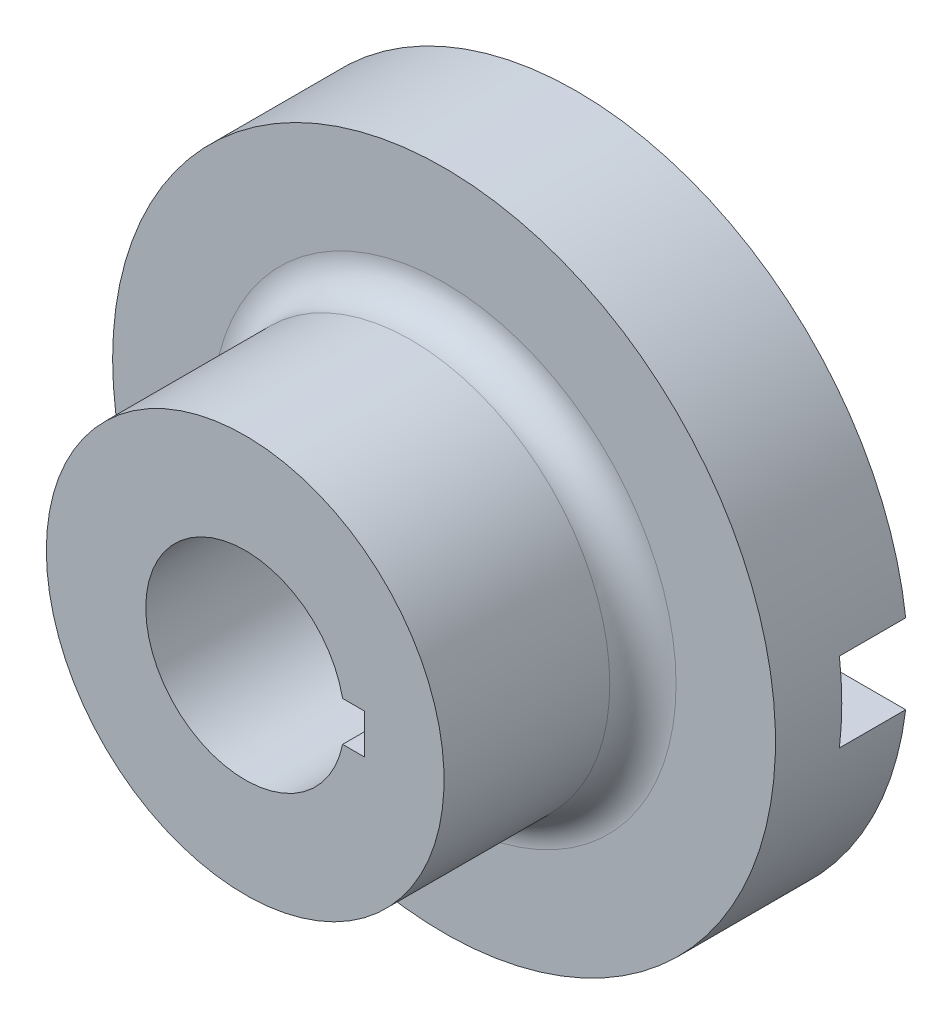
ISO-10303-21;
HEADER;
FILE_DESCRIPTION(('STEP AP214'),'2;1');
FILE_NAME('part.step','',(''),(''),'','','');
FILE_SCHEMA(('AUTOMOTIVE_DESIGN { 1 0 10303 214 1 1 1 1 }'));
ENDSEC;
DATA;
#1=APPLICATION_CONTEXT('core data for automotive mechanical design processes');
#2=APPLICATION_PROTOCOL_DEFINITION('international standard','automotive_design',2000,#1);
#3=PRODUCT_CONTEXT('',#1,'mechanical');
#4=PRODUCT('Part','Part','',(#3));
#5=PRODUCT_RELATED_PRODUCT_CATEGORY('part','',(#4));
#6=PRODUCT_DEFINITION_FORMATION('','',#4);
#7=PRODUCT_DEFINITION_CONTEXT('part definition',#1,'design');
#8=PRODUCT_DEFINITION('design','',#6,#7);
#9=PRODUCT_DEFINITION_SHAPE('','',#8);
#10=(LENGTH_UNIT() NAMED_UNIT(*) SI_UNIT(.MILLI.,.METRE.));
#11=(NAMED_UNIT(*) PLANE_ANGLE_UNIT() SI_UNIT($,.RADIAN.));
#12=(NAMED_UNIT(*) SI_UNIT($,.STERADIAN.) SOLID_ANGLE_UNIT());
#13=UNCERTAINTY_MEASURE_WITH_UNIT(LENGTH_MEASURE(1.E-05),#10,'distance_accuracy_value','');
#14=(GEOMETRIC_REPRESENTATION_CONTEXT(3) GLOBAL_UNCERTAINTY_ASSIGNED_CONTEXT((#13)) GLOBAL_UNIT_ASSIGNED_CONTEXT((#10,
#11,#12)) REPRESENTATION_CONTEXT('',''));
#15=CARTESIAN_POINT('',(0.,0.,0.));
#16=DIRECTION('',(0.,0.,1.));
#17=DIRECTION('',(1.,0.,0.));
#18=AXIS2_PLACEMENT_3D('',#15,#16,#17);
#19=CARTESIAN_POINT('',(0.,15.,0.));
#20=DIRECTION('',(0.,0.,-1.));
#21=DIRECTION('',(-1.,0.,0.));
#22=AXIS2_PLACEMENT_3D('',#19,#20,#21);
#23=PLANE('',#22);
#24=DIRECTION('',(1.,0.,0.));
#25=VECTOR('',#24,1.);
#26=CARTESIAN_POINT('',(-50.,6.00000000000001,0.));
#27=LINE('',#26,#25);
#28=CARTESIAN_POINT('',(-49.6386945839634,6.00000000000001,0.));
#29=VERTEX_POINT('',#28);
#30=CARTESIAN_POINT('',(-13.7477270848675,6.,0.));
#31=VERTEX_POINT('',#30);
#32=EDGE_CURVE('E154',#29,#31,#27,.T.);
#33=ORIENTED_EDGE('',*,*,#32,.F.);
#34=CARTESIAN_POINT('',(0.,0.,0.));
#35=DIRECTION('',(0.,0.,-1.));
#36=DIRECTION('',(-1.,0.,0.));
#37=AXIS2_PLACEMENT_3D('',#34,#35,#36);
#38=CIRCLE('',#37,50.);
#39=CARTESIAN_POINT('',(49.6386945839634,5.99999999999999,0.));
#40=VERTEX_POINT('',#39);
#41=EDGE_CURVE('E186',#29,#40,#38,.T.);
#42=ORIENTED_EDGE('',*,*,#41,.T.);
#43=CARTESIAN_POINT('',(13.7477270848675,6.,0.));
#44=VERTEX_POINT('',#43);
#45=EDGE_CURVE('E159',#44,#40,#27,.T.);
#46=ORIENTED_EDGE('',*,*,#45,.F.);
#47=CARTESIAN_POINT('',(0.,0.,0.));
#48=DIRECTION('',(0.,0.,-1.));
#49=DIRECTION('',(-1.,0.,0.));
#50=AXIS2_PLACEMENT_3D('',#47,#48,#49);
#51=CIRCLE('',#50,15.);
#52=EDGE_CURVE('E187',#31,#44,#51,.T.);
#53=ORIENTED_EDGE('',*,*,#52,.F.);
#54=EDGE_LOOP('',(#33,#42,#46,#53));
#55=FACE_BOUND('',#54,.T.);
#56=ADVANCED_FACE('F32',(#55),#23,.T.);
#57=CARTESIAN_POINT('',(0.,0.,0.));
#58=DIRECTION('',(0.,0.,-1.));
#59=DIRECTION('',(-1.,0.,0.));
#60=AXIS2_PLACEMENT_3D('',#57,#58,#59);
#61=CYLINDRICAL_SURFACE('',#60,15.);
#62=DIRECTION('',(0.,0.,-1.));
#63=VECTOR('',#62,1.);
#64=CARTESIAN_POINT('',(14.6969384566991,-3.,0.));
#65=LINE('',#64,#63);
#66=CARTESIAN_POINT('',(14.6969384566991,-3.,10.));
#67=VERTEX_POINT('',#66);
#68=CARTESIAN_POINT('',(14.6969384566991,-3.,50.));
#69=VERTEX_POINT('',#68);
#70=EDGE_CURVE('E127',#67,#69,#65,.F.);
#71=ORIENTED_EDGE('',*,*,#70,.F.);
#72=CARTESIAN_POINT('',(0.,0.,10.));
#73=DIRECTION('',(0.,0.,-1.));
#74=DIRECTION('',(-1.,0.,0.));
#75=AXIS2_PLACEMENT_3D('',#72,#73,#74);
#76=CIRCLE('',#75,15.);
#77=CARTESIAN_POINT('',(13.7477270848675,-6.,10.));
#78=VERTEX_POINT('',#77);
#79=EDGE_CURVE('E164',#67,#78,#76,.T.);
#80=ORIENTED_EDGE('',*,*,#79,.T.);
#81=DIRECTION('',(0.,0.,-1.));
#82=VECTOR('',#81,1.);
#83=CARTESIAN_POINT('',(13.7477270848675,-6.,0.));
#84=LINE('',#83,#82);
#85=CARTESIAN_POINT('',(13.7477270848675,-6.,0.));
#86=VERTEX_POINT('',#85);
#87=EDGE_CURVE('E166',#86,#78,#84,.F.);
#88=ORIENTED_EDGE('',*,*,#87,.F.);
#89=CARTESIAN_POINT('',(-13.7477270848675,-6.,0.));
#90=VERTEX_POINT('',#89);
#91=EDGE_CURVE('E191',#86,#90,#51,.T.);
#92=ORIENTED_EDGE('',*,*,#91,.T.);
#93=DIRECTION('',(0.,0.,-1.));
#94=VECTOR('',#93,1.);
#95=CARTESIAN_POINT('',(-13.7477270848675,-6.,0.));
#96=LINE('',#95,#94);
#97=CARTESIAN_POINT('',(-13.7477270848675,-6.,10.));
#98=VERTEX_POINT('',#97);
#99=EDGE_CURVE('E169',#98,#90,#96,.T.);
#100=ORIENTED_EDGE('',*,*,#99,.F.);
#101=CARTESIAN_POINT('',(-13.7477270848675,6.,10.));
#102=VERTEX_POINT('',#101);
#103=EDGE_CURVE('E161',#98,#102,#76,.T.);
#104=ORIENTED_EDGE('',*,*,#103,.T.);
#105=DIRECTION('',(0.,0.,-1.));
#106=VECTOR('',#105,1.);
#107=CARTESIAN_POINT('',(-13.7477270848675,6.,0.));
#108=LINE('',#107,#106);
#109=EDGE_CURVE('E171',#31,#102,#108,.F.);
#110=ORIENTED_EDGE('',*,*,#109,.F.);
#111=ORIENTED_EDGE('',*,*,#52,.T.);
#112=DIRECTION('',(0.,0.,-1.));
#113=VECTOR('',#112,1.);
#114=CARTESIAN_POINT('',(13.7477270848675,6.,0.));
#115=LINE('',#114,#113);
#116=CARTESIAN_POINT('',(13.7477270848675,6.,10.));
#117=VERTEX_POINT('',#116);
#118=EDGE_CURVE('E173',#117,#44,#115,.T.);
#119=ORIENTED_EDGE('',*,*,#118,.F.);
#120=CARTESIAN_POINT('',(14.6969384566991,3.,10.));
#121=VERTEX_POINT('',#120);
#122=EDGE_CURVE('E165',#117,#121,#76,.T.);
#123=ORIENTED_EDGE('',*,*,#122,.T.);
#124=DIRECTION('',(0.,0.,-1.));
#125=VECTOR('',#124,1.);
#126=CARTESIAN_POINT('',(14.6969384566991,3.,0.));
#127=LINE('',#126,#125);
#128=CARTESIAN_POINT('',(14.6969384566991,3.,50.));
#129=VERTEX_POINT('',#128);
#130=EDGE_CURVE('E145',#129,#121,#127,.T.);
#131=ORIENTED_EDGE('',*,*,#130,.F.);
#132=CARTESIAN_POINT('',(0.,0.,50.));
#133=DIRECTION('',(0.,0.,-1.));
#134=DIRECTION('',(-1.,0.,0.));
#135=AXIS2_PLACEMENT_3D('',#132,#133,#134);
#136=CIRCLE('',#135,15.);
#137=EDGE_CURVE('E175',#69,#129,#136,.T.);
#138=ORIENTED_EDGE('',*,*,#137,.F.);
#139=EDGE_LOOP('',(#71,#80,#88,#92,#100,#104,#110,#111,#119,#123,#131,#138));
#140=FACE_BOUND('',#139,.T.);
#141=ADVANCED_FACE('F222',(#140),#61,.F.);
#142=DIRECTION('',(-1.,0.,0.));
#143=VECTOR('',#142,1.);
#144=CARTESIAN_POINT('',(-50.,-5.99999999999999,0.));
#145=LINE('',#144,#143);
#146=CARTESIAN_POINT('',(49.6386945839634,-6.,0.));
#147=VERTEX_POINT('',#146);
#148=EDGE_CURVE('E158',#147,#86,#145,.T.);
#149=ORIENTED_EDGE('',*,*,#148,.F.);
#150=CARTESIAN_POINT('',(-49.6386945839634,-5.99999999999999,0.));
#151=VERTEX_POINT('',#150);
#152=EDGE_CURVE('E183',#147,#151,#38,.T.);
#153=ORIENTED_EDGE('',*,*,#152,.T.);
#154=EDGE_CURVE('E149',#90,#151,#145,.T.);
#155=ORIENTED_EDGE('',*,*,#154,.F.);
#156=ORIENTED_EDGE('',*,*,#91,.F.);
#157=EDGE_LOOP('',(#149,#153,#155,#156));
#158=FACE_BOUND('',#157,.T.);
#159=ADVANCED_FACE('F225',(#158),#23,.T.);
#160=CARTESIAN_POINT('',(0.,0.,0.));
#161=DIRECTION('',(0.,0.,-1.));
#162=DIRECTION('',(-1.,0.,0.));
#163=AXIS2_PLACEMENT_3D('',#160,#161,#162);
#164=CYLINDRICAL_SURFACE('',#163,50.);
#165=DIRECTION('',(0.,0.,-1.));
#166=VECTOR('',#165,1.);
#167=CARTESIAN_POINT('',(49.6386945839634,5.99999999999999,0.));
#168=LINE('',#167,#166);
#169=CARTESIAN_POINT('',(49.6386945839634,5.99999999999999,10.));
#170=VERTEX_POINT('',#169);
#171=EDGE_CURVE('E201',#40,#170,#168,.F.);
#172=ORIENTED_EDGE('',*,*,#171,.F.);
#173=ORIENTED_EDGE('',*,*,#41,.F.);
#174=DIRECTION('',(0.,0.,-1.));
#175=VECTOR('',#174,1.);
#176=CARTESIAN_POINT('',(-49.6386945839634,6.00000000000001,0.));
#177=LINE('',#176,#175);
#178=CARTESIAN_POINT('',(-49.6386945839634,6.00000000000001,10.));
#179=VERTEX_POINT('',#178);
#180=EDGE_CURVE('E197',#179,#29,#177,.T.);
#181=ORIENTED_EDGE('',*,*,#180,.F.);
#182=CARTESIAN_POINT('',(0.,0.,10.));
#183=DIRECTION('',(0.,0.,-1.));
#184=DIRECTION('',(-1.,0.,0.));
#185=AXIS2_PLACEMENT_3D('',#182,#183,#184);
#186=CIRCLE('',#185,50.);
#187=CARTESIAN_POINT('',(-49.6386945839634,-5.99999999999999,10.));
#188=VERTEX_POINT('',#187);
#189=EDGE_CURVE('E190',#179,#188,#186,.F.);
#190=ORIENTED_EDGE('',*,*,#189,.T.);
#191=DIRECTION('',(0.,0.,-1.));
#192=VECTOR('',#191,1.);
#193=CARTESIAN_POINT('',(-49.6386945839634,-5.99999999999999,0.));
#194=LINE('',#193,#192);
#195=EDGE_CURVE('E193',#151,#188,#194,.F.);
#196=ORIENTED_EDGE('',*,*,#195,.F.);
#197=ORIENTED_EDGE('',*,*,#152,.F.);
#198=DIRECTION('',(0.,0.,-1.));
#199=VECTOR('',#198,1.);
#200=CARTESIAN_POINT('',(49.6386945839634,-6.,0.));
#201=LINE('',#200,#199);
#202=CARTESIAN_POINT('',(49.6386945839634,-6.,10.));
#203=VERTEX_POINT('',#202);
#204=EDGE_CURVE('E199',#203,#147,#201,.T.);
#205=ORIENTED_EDGE('',*,*,#204,.F.);
#206=EDGE_CURVE('E194',#203,#170,#186,.F.);
#207=ORIENTED_EDGE('',*,*,#206,.T.);
#208=EDGE_LOOP('',(#172,#173,#181,#190,#196,#197,#205,#207));
#209=FACE_BOUND('',#208,.T.);
#210=CARTESIAN_POINT('',(0.,0.,20.));
#211=DIRECTION('',(0.,0.,-1.));
#212=DIRECTION('',(-1.,0.,0.));
#213=AXIS2_PLACEMENT_3D('',#210,#211,#212);
#214=CIRCLE('',#213,50.);
#215=CARTESIAN_POINT('',(-50.,0.,20.));
#216=VERTEX_POINT('',#215);
#217=EDGE_CURVE('E180',#216,#216,#214,.T.);
#218=ORIENTED_EDGE('',*,*,#217,.T.);
#219=EDGE_LOOP('',(#218));
#220=FACE_BOUND('',#219,.T.);
#221=ADVANCED_FACE('F233',(#209,#220),#164,.T.);
#222=CARTESIAN_POINT('',(0.,50.,20.));
#223=DIRECTION('',(0.,0.,1.));
#224=DIRECTION('',(1.,0.,0.));
#225=AXIS2_PLACEMENT_3D('',#222,#223,#224);
#226=PLANE('',#225);
#227=CARTESIAN_POINT('',(0.,0.,20.));
#228=DIRECTION('',(0.,0.,1.));
#229=DIRECTION('',(1.,0.,0.));
#230=AXIS2_PLACEMENT_3D('',#227,#228,#229);
#231=CIRCLE('',#230,35.);
#232=CARTESIAN_POINT('',(35.,0.,20.));
#233=VERTEX_POINT('',#232);
#234=EDGE_CURVE('E40',#233,#233,#231,.F.);
#235=ORIENTED_EDGE('',*,*,#234,.T.);
#236=EDGE_LOOP('',(#235));
#237=FACE_BOUND('',#236,.T.);
#238=ORIENTED_EDGE('',*,*,#217,.F.);
#239=EDGE_LOOP('',(#238));
#240=FACE_BOUND('',#239,.T.);
#241=ADVANCED_FACE('F210',(#237,#240),#226,.T.);
#242=CARTESIAN_POINT('',(0.,0.,0.));
#243=DIRECTION('',(0.,0.,-1.));
#244=DIRECTION('',(-1.,0.,0.));
#245=AXIS2_PLACEMENT_3D('',#242,#243,#244);
#246=CYLINDRICAL_SURFACE('',#245,30.);
#247=CARTESIAN_POINT('',(0.,0.,25.));
#248=DIRECTION('',(0.,0.,1.));
#249=DIRECTION('',(1.,0.,0.));
#250=AXIS2_PLACEMENT_3D('',#247,#248,#249);
#251=CIRCLE('',#250,30.);
#252=CARTESIAN_POINT('',(30.,0.,25.));
#253=VERTEX_POINT('',#252);
#254=EDGE_CURVE('E11',#253,#253,#251,.T.);
#255=ORIENTED_EDGE('',*,*,#254,.T.);
#256=EDGE_LOOP('',(#255));
#257=FACE_BOUND('',#256,.T.);
#258=CARTESIAN_POINT('',(0.,0.,50.));
#259=DIRECTION('',(0.,0.,-1.));
#260=DIRECTION('',(-1.,0.,0.));
#261=AXIS2_PLACEMENT_3D('',#258,#259,#260);
#262=CIRCLE('',#261,30.);
#263=CARTESIAN_POINT('',(-30.,0.,50.));
#264=VERTEX_POINT('',#263);
#265=EDGE_CURVE('E177',#264,#264,#262,.T.);
#266=ORIENTED_EDGE('',*,*,#265,.T.);
#267=EDGE_LOOP('',(#266));
#268=FACE_BOUND('',#267,.T.);
#269=ADVANCED_FACE('F291',(#257,#268),#246,.T.);
#270=CARTESIAN_POINT('',(0.,30.,50.));
#271=DIRECTION('',(0.,0.,1.));
#272=DIRECTION('',(1.,0.,0.));
#273=AXIS2_PLACEMENT_3D('',#270,#271,#272);
#274=PLANE('',#273);
#275=DIRECTION('',(1.,0.,0.));
#276=VECTOR('',#275,1.);
#277=CARTESIAN_POINT('',(14.,-3.,50.));
#278=LINE('',#277,#276);
#279=CARTESIAN_POINT('',(18.,-3.,50.));
#280=VERTEX_POINT('',#279);
#281=EDGE_CURVE('E121',#69,#280,#278,.T.);
#282=ORIENTED_EDGE('',*,*,#281,.F.);
#283=ORIENTED_EDGE('',*,*,#137,.T.);
#284=DIRECTION('',(-1.,0.,0.));
#285=VECTOR('',#284,1.);
#286=CARTESIAN_POINT('',(14.,3.,50.));
#287=LINE('',#286,#285);
#288=CARTESIAN_POINT('',(18.,3.,50.));
#289=VERTEX_POINT('',#288);
#290=EDGE_CURVE('E138',#289,#129,#287,.T.);
#291=ORIENTED_EDGE('',*,*,#290,.F.);
#292=DIRECTION('',(0.,1.,0.));
#293=VECTOR('',#292,1.);
#294=CARTESIAN_POINT('',(18.,-3.,50.));
#295=LINE('',#294,#293);
#296=EDGE_CURVE('E132',#280,#289,#295,.T.);
#297=ORIENTED_EDGE('',*,*,#296,.F.);
#298=EDGE_LOOP('',(#282,#283,#291,#297));
#299=FACE_BOUND('',#298,.T.);
#300=ORIENTED_EDGE('',*,*,#265,.F.);
#301=EDGE_LOOP('',(#300));
#302=FACE_BOUND('',#301,.T.);
#303=ADVANCED_FACE('F140',(#299,#302),#274,.T.);
#304=CARTESIAN_POINT('',(0.,0.,10.));
#305=DIRECTION('',(0.,0.,-1.));
#306=DIRECTION('',(-1.,0.,0.));
#307=AXIS2_PLACEMENT_3D('',#304,#305,#306);
#308=PLANE('',#307);
#309=DIRECTION('',(-1.,0.,0.));
#310=VECTOR('',#309,1.);
#311=CARTESIAN_POINT('',(-50.,-5.99999999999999,10.));
#312=LINE('',#311,#310);
#313=EDGE_CURVE('E150',#98,#188,#312,.T.);
#314=ORIENTED_EDGE('',*,*,#313,.T.);
#315=ORIENTED_EDGE('',*,*,#189,.F.);
#316=DIRECTION('',(1.,0.,0.));
#317=VECTOR('',#316,1.);
#318=CARTESIAN_POINT('',(-50.,6.00000000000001,10.));
#319=LINE('',#318,#317);
#320=EDGE_CURVE('E156',#179,#102,#319,.T.);
#321=ORIENTED_EDGE('',*,*,#320,.T.);
#322=ORIENTED_EDGE('',*,*,#103,.F.);
#323=EDGE_LOOP('',(#314,#315,#321,#322));
#324=FACE_BOUND('',#323,.T.);
#325=ADVANCED_FACE('F257',(#324),#308,.T.);
#326=CARTESIAN_POINT('',(-50.,-5.99999999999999,10.));
#327=DIRECTION('',(0.,-1.,0.));
#328=DIRECTION('',(1.,0.,0.));
#329=AXIS2_PLACEMENT_3D('',#326,#327,#328);
#330=PLANE('',#329);
#331=ORIENTED_EDGE('',*,*,#99,.T.);
#332=ORIENTED_EDGE('',*,*,#154,.T.);
#333=ORIENTED_EDGE('',*,*,#195,.T.);
#334=ORIENTED_EDGE('',*,*,#313,.F.);
#335=EDGE_LOOP('',(#331,#332,#333,#334));
#336=FACE_BOUND('',#335,.T.);
#337=ADVANCED_FACE('F254',(#336),#330,.F.);
#338=CARTESIAN_POINT('',(-50.,6.00000000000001,10.));
#339=DIRECTION('',(0.,1.,0.));
#340=DIRECTION('',(-1.,0.,0.));
#341=AXIS2_PLACEMENT_3D('',#338,#339,#340);
#342=PLANE('',#341);
#343=ORIENTED_EDGE('',*,*,#109,.T.);
#344=ORIENTED_EDGE('',*,*,#320,.F.);
#345=ORIENTED_EDGE('',*,*,#180,.T.);
#346=ORIENTED_EDGE('',*,*,#32,.T.);
#347=EDGE_LOOP('',(#343,#344,#345,#346));
#348=FACE_BOUND('',#347,.T.);
#349=ADVANCED_FACE('F283',(#348),#342,.F.);
#350=ORIENTED_EDGE('',*,*,#118,.T.);
#351=ORIENTED_EDGE('',*,*,#45,.T.);
#352=ORIENTED_EDGE('',*,*,#171,.T.);
#353=EDGE_CURVE('E55',#117,#170,#319,.T.);
#354=ORIENTED_EDGE('',*,*,#353,.F.);
#355=EDGE_LOOP('',(#350,#351,#352,#354));
#356=FACE_BOUND('',#355,.T.);
#357=ADVANCED_FACE('F266',(#356),#342,.F.);
#358=DIRECTION('',(-1.,0.,0.));
#359=VECTOR('',#358,1.);
#360=CARTESIAN_POINT('',(0.,-3.,10.));
#361=LINE('',#360,#359);
#362=CARTESIAN_POINT('',(18.,-3.,10.));
#363=VERTEX_POINT('',#362);
#364=EDGE_CURVE('E206',#363,#67,#361,.T.);
#365=ORIENTED_EDGE('',*,*,#364,.F.);
#366=DIRECTION('',(0.,-1.,0.));
#367=VECTOR('',#366,1.);
#368=CARTESIAN_POINT('',(18.,0.,10.));
#369=LINE('',#368,#367);
#370=CARTESIAN_POINT('',(18.,3.,10.));
#371=VERTEX_POINT('',#370);
#372=EDGE_CURVE('E137',#371,#363,#369,.T.);
#373=ORIENTED_EDGE('',*,*,#372,.F.);
#374=DIRECTION('',(1.,0.,0.));
#375=VECTOR('',#374,1.);
#376=CARTESIAN_POINT('',(0.,3.,10.));
#377=LINE('',#376,#375);
#378=EDGE_CURVE('E204',#121,#371,#377,.T.);
#379=ORIENTED_EDGE('',*,*,#378,.F.);
#380=ORIENTED_EDGE('',*,*,#122,.F.);
#381=ORIENTED_EDGE('',*,*,#353,.T.);
#382=ORIENTED_EDGE('',*,*,#206,.F.);
#383=EDGE_CURVE('E153',#203,#78,#312,.T.);
#384=ORIENTED_EDGE('',*,*,#383,.T.);
#385=ORIENTED_EDGE('',*,*,#79,.F.);
#386=EDGE_LOOP('',(#365,#373,#379,#380,#381,#382,#384,#385));
#387=FACE_BOUND('',#386,.T.);
#388=ADVANCED_FACE('F275',(#387),#308,.T.);
#389=ORIENTED_EDGE('',*,*,#87,.T.);
#390=ORIENTED_EDGE('',*,*,#383,.F.);
#391=ORIENTED_EDGE('',*,*,#204,.T.);
#392=ORIENTED_EDGE('',*,*,#148,.T.);
#393=EDGE_LOOP('',(#389,#390,#391,#392));
#394=FACE_BOUND('',#393,.T.);
#395=ADVANCED_FACE('F274',(#394),#330,.F.);
#396=CARTESIAN_POINT('',(14.,-3.,0.));
#397=DIRECTION('',(0.,-1.,0.));
#398=DIRECTION('',(1.,0.,0.));
#399=AXIS2_PLACEMENT_3D('',#396,#397,#398);
#400=PLANE('',#399);
#401=ORIENTED_EDGE('',*,*,#70,.T.);
#402=ORIENTED_EDGE('',*,*,#281,.T.);
#403=DIRECTION('',(0.,0.,1.));
#404=VECTOR('',#403,1.);
#405=CARTESIAN_POINT('',(18.,-3.,0.));
#406=LINE('',#405,#404);
#407=EDGE_CURVE('E124',#363,#280,#406,.T.);
#408=ORIENTED_EDGE('',*,*,#407,.F.);
#409=ORIENTED_EDGE('',*,*,#364,.T.);
#410=EDGE_LOOP('',(#401,#402,#408,#409));
#411=FACE_BOUND('',#410,.T.);
#412=ADVANCED_FACE('F123',(#411),#400,.F.);
#413=CARTESIAN_POINT('',(14.,3.,0.));
#414=DIRECTION('',(0.,1.,0.));
#415=DIRECTION('',(-1.,0.,0.));
#416=AXIS2_PLACEMENT_3D('',#413,#414,#415);
#417=PLANE('',#416);
#418=ORIENTED_EDGE('',*,*,#130,.T.);
#419=ORIENTED_EDGE('',*,*,#378,.T.);
#420=DIRECTION('',(0.,0.,1.));
#421=VECTOR('',#420,1.);
#422=CARTESIAN_POINT('',(18.,3.,0.));
#423=LINE('',#422,#421);
#424=EDGE_CURVE('E47',#371,#289,#423,.T.);
#425=ORIENTED_EDGE('',*,*,#424,.T.);
#426=ORIENTED_EDGE('',*,*,#290,.T.);
#427=EDGE_LOOP('',(#418,#419,#425,#426));
#428=FACE_BOUND('',#427,.T.);
#429=ADVANCED_FACE('F218',(#428),#417,.F.);
#430=CARTESIAN_POINT('',(18.,-3.,0.));
#431=DIRECTION('',(1.,0.,0.));
#432=DIRECTION('',(0.,0.,-1.));
#433=AXIS2_PLACEMENT_3D('',#430,#431,#432);
#434=PLANE('',#433);
#435=ORIENTED_EDGE('',*,*,#372,.T.);
#436=ORIENTED_EDGE('',*,*,#407,.T.);
#437=ORIENTED_EDGE('',*,*,#296,.T.);
#438=ORIENTED_EDGE('',*,*,#424,.F.);
#439=EDGE_LOOP('',(#435,#436,#437,#438));
#440=FACE_BOUND('',#439,.T.);
#441=ADVANCED_FACE('F134',(#440),#434,.F.);
#442=CARTESIAN_POINT('',(0.,0.,25.));
#443=DIRECTION('',(0.,0.,1.));
#444=DIRECTION('',(1.,0.,0.));
#445=AXIS2_PLACEMENT_3D('',#442,#443,#444);
#446=TOROIDAL_SURFACE('',#445,35.,5.);
#447=ORIENTED_EDGE('',*,*,#254,.F.);
#448=EDGE_LOOP('',(#447));
#449=FACE_BOUND('',#448,.T.);
#450=ORIENTED_EDGE('',*,*,#234,.F.);
#451=EDGE_LOOP('',(#450));
#452=FACE_BOUND('',#451,.T.);
#453=ADVANCED_FACE('F34',(#449,#452),#446,.F.);
#454=CLOSED_SHELL('',(#56,#141,#159,#221,#241,#269,#303,#325,#337,#349,#357,#388,#395,#412,#429,
#441,#453));
#455=MANIFOLD_SOLID_BREP('B2',#454);
#456=ADVANCED_BREP_SHAPE_REPRESENTATION('',(#18,#455),#14);
#457=SHAPE_DEFINITION_REPRESENTATION(#9,#456);
ENDSEC;
END-ISO-10303-21;
